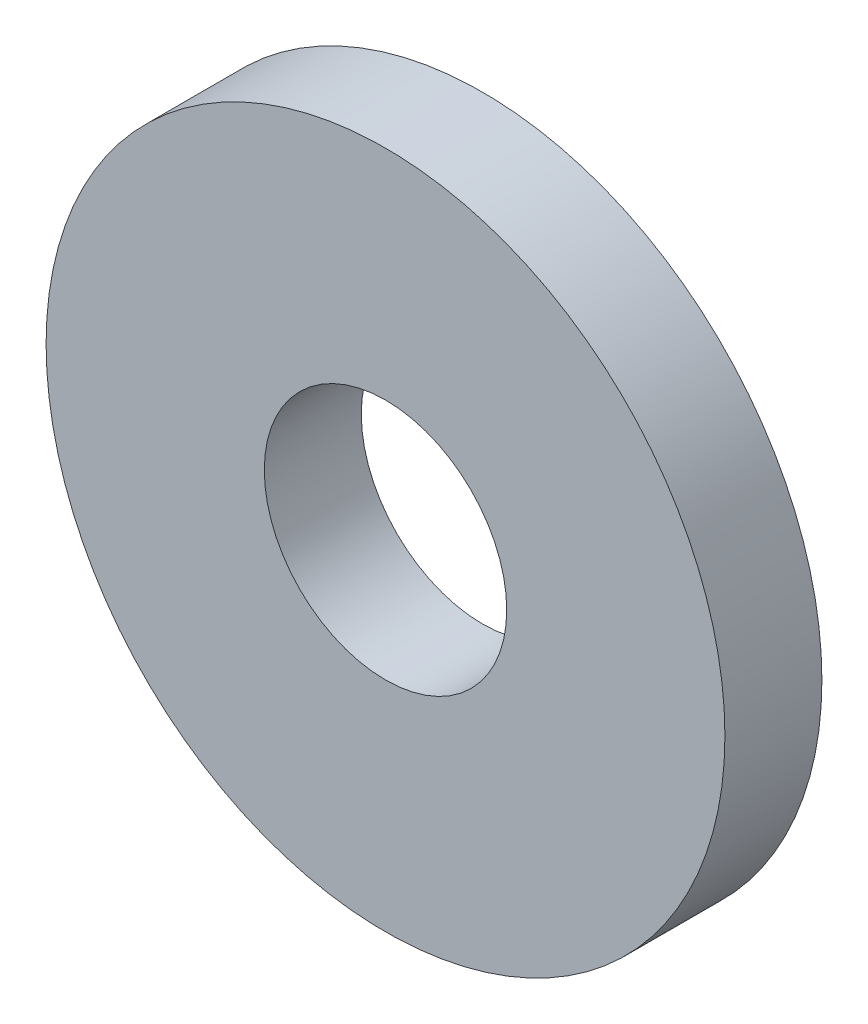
ISO-10303-21;
HEADER;
FILE_DESCRIPTION(('STEP AP214'),'2;1');
FILE_NAME('part.step','',(''),(''),'','','');
FILE_SCHEMA(('AUTOMOTIVE_DESIGN { 1 0 10303 214 1 1 1 1 }'));
ENDSEC;
DATA;
#1=APPLICATION_CONTEXT('core data for automotive mechanical design processes');
#2=APPLICATION_PROTOCOL_DEFINITION('international standard','automotive_design',2000,#1);
#3=PRODUCT_CONTEXT('',#1,'mechanical');
#4=PRODUCT('Part','Part','',(#3));
#5=PRODUCT_RELATED_PRODUCT_CATEGORY('part','',(#4));
#6=PRODUCT_DEFINITION_FORMATION('','',#4);
#7=PRODUCT_DEFINITION_CONTEXT('part definition',#1,'design');
#8=PRODUCT_DEFINITION('design','',#6,#7);
#9=PRODUCT_DEFINITION_SHAPE('','',#8);
#10=(LENGTH_UNIT() NAMED_UNIT(*) SI_UNIT(.MILLI.,.METRE.));
#11=(NAMED_UNIT(*) PLANE_ANGLE_UNIT() SI_UNIT($,.RADIAN.));
#12=(NAMED_UNIT(*) SI_UNIT($,.STERADIAN.) SOLID_ANGLE_UNIT());
#13=UNCERTAINTY_MEASURE_WITH_UNIT(LENGTH_MEASURE(1.E-05),#10,'distance_accuracy_value','');
#14=(GEOMETRIC_REPRESENTATION_CONTEXT(3) GLOBAL_UNCERTAINTY_ASSIGNED_CONTEXT((#13)) GLOBAL_UNIT_ASSIGNED_CONTEXT((#10,
#11,#12)) REPRESENTATION_CONTEXT('',''));
#15=CARTESIAN_POINT('',(0.,0.,0.));
#16=DIRECTION('',(0.,0.,1.));
#17=DIRECTION('',(1.,0.,0.));
#18=AXIS2_PLACEMENT_3D('',#15,#16,#17);
#19=CARTESIAN_POINT('',(0.,0.,0.));
#20=DIRECTION('',(0.,0.,-1.));
#21=DIRECTION('',(-1.,0.,0.));
#22=AXIS2_PLACEMENT_3D('',#19,#20,#21);
#23=PLANE('',#22);
#24=CARTESIAN_POINT('',(0.,0.,0.));
#25=DIRECTION('',(0.,0.,-1.));
#26=DIRECTION('',(-1.,0.,0.));
#27=AXIS2_PLACEMENT_3D('',#24,#25,#26);
#28=CIRCLE('',#27,6.25);
#29=CARTESIAN_POINT('',(-6.25,0.,0.));
#30=VERTEX_POINT('',#29);
#31=EDGE_CURVE('E43',#30,#30,#28,.T.);
#32=ORIENTED_EDGE('',*,*,#31,.T.);
#33=EDGE_LOOP('',(#32));
#34=FACE_BOUND('',#33,.T.);
#35=CARTESIAN_POINT('',(0.,0.,0.));
#36=DIRECTION('',(0.,0.,-1.));
#37=DIRECTION('',(-1.,0.,0.));
#38=AXIS2_PLACEMENT_3D('',#35,#36,#37);
#39=CIRCLE('',#38,17.5);
#40=CARTESIAN_POINT('',(-17.5,0.,0.));
#41=VERTEX_POINT('',#40);
#42=EDGE_CURVE('E10',#41,#41,#39,.T.);
#43=ORIENTED_EDGE('',*,*,#42,.F.);
#44=EDGE_LOOP('',(#43));
#45=FACE_BOUND('',#44,.T.);
#46=ADVANCED_FACE('F33',(#34,#45),#23,.F.);
#47=CARTESIAN_POINT('',(0.,0.,0.));
#48=DIRECTION('',(0.,0.,-1.));
#49=DIRECTION('',(-1.,0.,0.));
#50=AXIS2_PLACEMENT_3D('',#47,#48,#49);
#51=CYLINDRICAL_SURFACE('',#50,17.5);
#52=CARTESIAN_POINT('',(0.,0.,-5.));
#53=DIRECTION('',(0.,0.,-1.));
#54=DIRECTION('',(-1.,0.,0.));
#55=AXIS2_PLACEMENT_3D('',#52,#53,#54);
#56=CIRCLE('',#55,17.5);
#57=CARTESIAN_POINT('',(-17.5,0.,-5.));
#58=VERTEX_POINT('',#57);
#59=EDGE_CURVE('E39',#58,#58,#56,.T.);
#60=ORIENTED_EDGE('',*,*,#59,.F.);
#61=EDGE_LOOP('',(#60));
#62=FACE_BOUND('',#61,.T.);
#63=ORIENTED_EDGE('',*,*,#42,.T.);
#64=EDGE_LOOP('',(#63));
#65=FACE_BOUND('',#64,.T.);
#66=ADVANCED_FACE('F58',(#62,#65),#51,.T.);
#67=CARTESIAN_POINT('',(0.,0.,-5.));
#68=DIRECTION('',(0.,0.,1.));
#69=DIRECTION('',(1.,0.,0.));
#70=AXIS2_PLACEMENT_3D('',#67,#68,#69);
#71=PLANE('',#70);
#72=CARTESIAN_POINT('',(0.,0.,-5.));
#73=DIRECTION('',(0.,0.,-1.));
#74=DIRECTION('',(-1.,0.,0.));
#75=AXIS2_PLACEMENT_3D('',#72,#73,#74);
#76=CIRCLE('',#75,6.25);
#77=CARTESIAN_POINT('',(-6.25,0.,-5.));
#78=VERTEX_POINT('',#77);
#79=EDGE_CURVE('E47',#78,#78,#76,.T.);
#80=ORIENTED_EDGE('',*,*,#79,.F.);
#81=EDGE_LOOP('',(#80));
#82=FACE_BOUND('',#81,.T.);
#83=ORIENTED_EDGE('',*,*,#59,.T.);
#84=EDGE_LOOP('',(#83));
#85=FACE_BOUND('',#84,.T.);
#86=ADVANCED_FACE('F56',(#82,#85),#71,.F.);
#87=CARTESIAN_POINT('',(0.,0.,0.));
#88=DIRECTION('',(0.,0.,-1.));
#89=DIRECTION('',(-1.,0.,0.));
#90=AXIS2_PLACEMENT_3D('',#87,#88,#89);
#91=CYLINDRICAL_SURFACE('',#90,6.25);
#92=ORIENTED_EDGE('',*,*,#79,.T.);
#93=EDGE_LOOP('',(#92));
#94=FACE_BOUND('',#93,.T.);
#95=ORIENTED_EDGE('',*,*,#31,.F.);
#96=EDGE_LOOP('',(#95));
#97=FACE_BOUND('',#96,.T.);
#98=ADVANCED_FACE('F53',(#94,#97),#91,.F.);
#99=CLOSED_SHELL('',(#46,#66,#86,#98));
#100=MANIFOLD_SOLID_BREP('B2',#99);
#101=ADVANCED_BREP_SHAPE_REPRESENTATION('',(#18,#100),#14);
#102=SHAPE_DEFINITION_REPRESENTATION(#9,#101);
ENDSEC;
END-ISO-10303-21;
